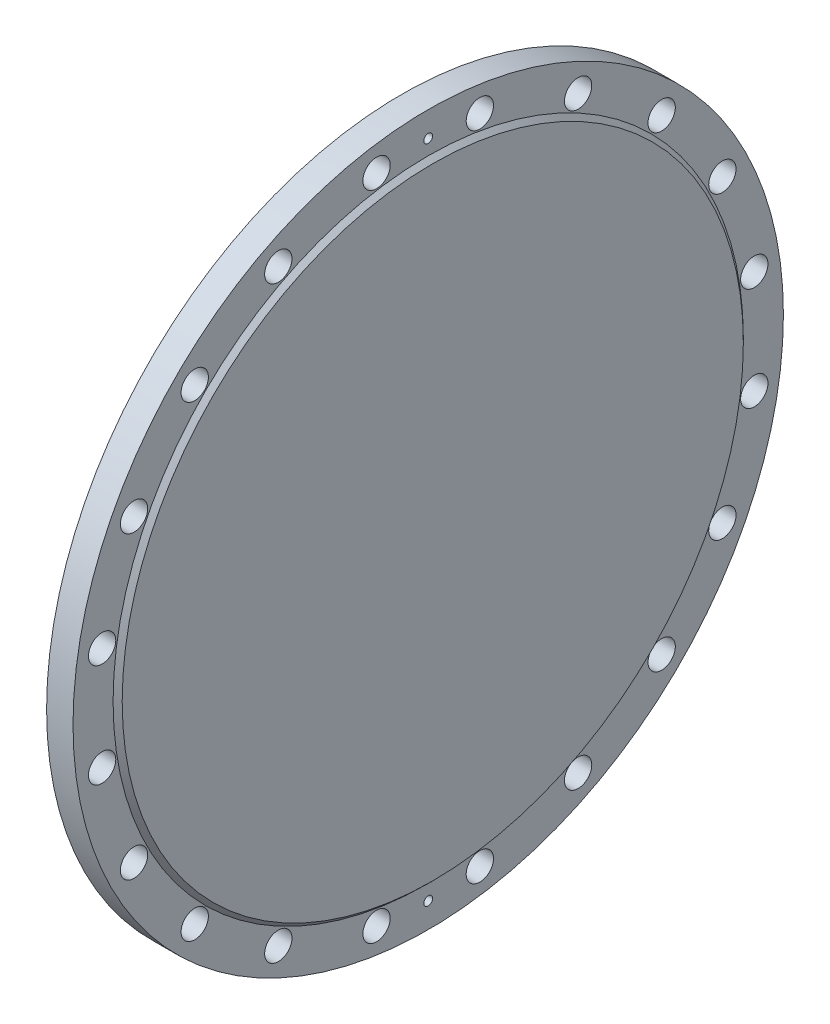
from build123d import *

# Parameters (mm, degrees)
ESQUISSE2_R             = 15
ENL_V_MAT_EXTRU_1_DEPTH = 553.59026412
ESQUISSE3_R             = 4.8
EXTRUSION1_DEPTH        = 553.59026412


with BuildPart() as part:
    # Esquisse1 → R_volution1 (revolve)
    with BuildSketch(Plane.XY, mode=Mode.PRIVATE) as r_volution1_sk:
        Polygon((-787, 390), (-787, 346), (-782, 341), (-782, 0), (-816, 0), (-816, 390), align=None)
    revolve(r_volution1_sk.sketch.rotate(Axis((0, 0, 0), (-1, 0, 0)), 90), axis=Axis((0, 0, 0), (-1, 0, 0)))

    # Esquisse2 → Enl_v. mat.-Extru.1 (cut, through all)
    with BuildSketch(Plane.ZY.offset(816)):
        with Locations((256.32620818, 256.32620818)):
            Circle(ESQUISSE2_R)
        with Locations((322.989865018, 164.571556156)):
            Circle(ESQUISSE2_R)
        with Locations((358.037023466, 56.707493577)):
            Circle(ESQUISSE2_R)
        with Locations((358.037023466, -56.707493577)):
            Circle(ESQUISSE2_R)
        with Locations((322.989865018, -164.571556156)):
            Circle(ESQUISSE2_R)
        with Locations((256.32620818, -256.32620818)):
            Circle(ESQUISSE2_R)
        with Locations((164.571556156, -322.989865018)):
            Circle(ESQUISSE2_R)
        with Locations((56.707493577, -358.037023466)):
            Circle(ESQUISSE2_R)
        with Locations((-56.707493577, -358.037023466)):
            Circle(ESQUISSE2_R)
        with Locations((-164.571556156, -322.989865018)):
            Circle(ESQUISSE2_R)
        with Locations((-256.32620818, -256.32620818)):
            Circle(ESQUISSE2_R)
        with Locations((-322.989865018, -164.571556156)):
            Circle(ESQUISSE2_R)
        with Locations((-358.037023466, -56.707493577)):
            Circle(ESQUISSE2_R)
        with Locations((-358.037023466, 56.707493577)):
            Circle(ESQUISSE2_R)
        with Locations((-322.989865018, 164.571556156)):
            Circle(ESQUISSE2_R)
        with Locations((-256.32620818, 256.32620818)):
            Circle(ESQUISSE2_R)
        with Locations((-164.571556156, 322.989865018)):
            Circle(ESQUISSE2_R)
        with Locations((-56.707493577, 358.037023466)):
            Circle(ESQUISSE2_R)
        with Locations((56.707493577, 358.037023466)):
            Circle(ESQUISSE2_R)
        with Locations((164.571556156, 322.989865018)):
            Circle(ESQUISSE2_R)
    extrude(amount=-ENL_V_MAT_EXTRU_1_DEPTH, mode=Mode.SUBTRACT)

    # Esquisse3 → Extrusion1 (cut, through all)
    with BuildSketch(Plane.ZY.offset(816)):
        with Locations((0, 362.5)):
            Circle(ESQUISSE3_R)
        with Locations((0, -362.5)):
            Circle(ESQUISSE3_R)
    extrude(amount=-EXTRUSION1_DEPTH, mode=Mode.SUBTRACT)


solid = part.part
